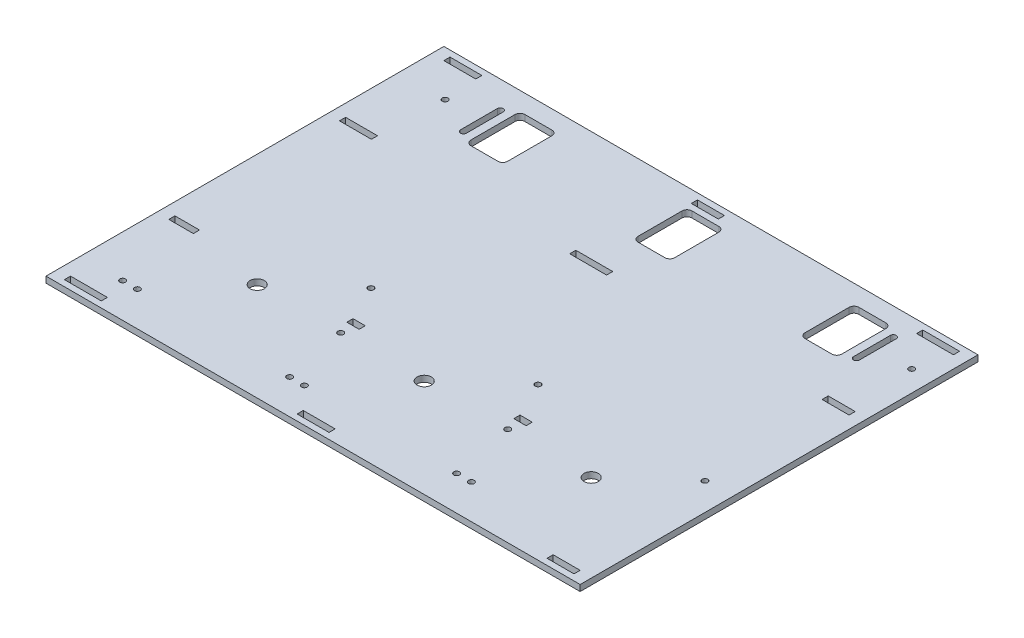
from build123d import *

# Parameters (mm, degrees)
SKETCH1_W             = 276.225
SKETCH1_H             = 205.74
SKETCH1_R             = 3.683
SKETCH1_W_2           = 13.97
SKETCH1_H_2           = 3.175
SKETCH1_W_3           = 19.05
SKETCH1_W_4           = 16.51
SKETCH1_W_5           = 6.35
SKETCH1_W_6           = 12.7
SKETCH1_H_3           = 27.94
BOSS_EXTRUDE1_DEPTH   = 3.175
F_4_CLEARANCE_HOLE1_D = 2.9464
FILLET1_R             = 2.54


with BuildPart() as part:
    # Sketch1 → Boss-Extrude1 (new body)
    with BuildSketch(Plane(origin=(0, 0, 0), x_dir=(1, 0, 0), z_dir=(0, 1, 0))):
        with Locations((138.1125, 102.87)):
            Rectangle(SKETCH1_W, SKETCH1_H)
        with Locations(Location((231.14, 50.8, 0), (0, 0, 270))):
            Circle(SKETCH1_R, mode=Mode.SUBTRACT)
        with Locations(Location((144.78, 50.8, 0), (0, 0, 270))):
            Circle(SKETCH1_R, mode=Mode.SUBTRACT)
        with Locations(Location((58.42, 50.8, 0), (0, 0, 270))):
            Circle(SKETCH1_R, mode=Mode.SUBTRACT)
        with Locations((262.89, 147.0025)):
            Rectangle(SKETCH1_W_2, SKETCH1_H_2, mode=Mode.SUBTRACT)
        with Locations((260.35, 200.9775)):
            Rectangle(SKETCH1_W_3, SKETCH1_H_2, mode=Mode.SUBTRACT)
        with Locations((141.2875, 200.9775)):
            Rectangle(SKETCH1_W_2, SKETCH1_H_2, mode=Mode.SUBTRACT)
        with Locations((14.605, 200.9775)):
            Rectangle(SKETCH1_W_4, SKETCH1_H_2, mode=Mode.SUBTRACT)
        with Locations((134.9375, 147.0025)):
            Rectangle(SKETCH1_W_3, SKETCH1_H_2, mode=Mode.SUBTRACT)
        with Locations((14.605, 147.0025)):
            Rectangle(SKETCH1_W_4, SKETCH1_H_2, mode=Mode.SUBTRACT)
        with Locations((187.96, 58.7375)):
            Rectangle(SKETCH1_W_5, SKETCH1_H_2, mode=Mode.SUBTRACT)
        with Locations((101.6, 58.7375)):
            Rectangle(SKETCH1_W_5, SKETCH1_H_2, mode=Mode.SUBTRACT)
        with Locations((12.7, 58.7375)):
            Rectangle(SKETCH1_W_6, SKETCH1_H_2, mode=Mode.SUBTRACT)
        with Locations((262.89, 4.7625)):
            Rectangle(SKETCH1_W_2, SKETCH1_H_2, mode=Mode.SUBTRACT)
        with Locations((134.9375, 4.7625)):
            Rectangle(SKETCH1_W_4, SKETCH1_H_2, mode=Mode.SUBTRACT)
        with Locations((15.875, 4.7625)):
            Rectangle(SKETCH1_W_3, SKETCH1_H_2, mode=Mode.SUBTRACT)
        with Locations((144.78, 182.245)):
            Rectangle(SKETCH1_W_3, SKETCH1_H_3, mode=Mode.SUBTRACT)
        with Locations((231.14, 182.245)):
            Rectangle(SKETCH1_W_3, SKETCH1_H_3, mode=Mode.SUBTRACT)
        with Locations((58.42, 182.245)):
            Rectangle(SKETCH1_W_3, SKETCH1_H_3, mode=Mode.SUBTRACT)
        with BuildLine():
            Line((44.704, 191.77), (44.704, 172.72))
            ThreePointArc((44.704, 172.72), (43.18, 171.196), (41.656, 172.72))
            Line((41.656, 172.72), (41.656, 191.77))
            ThreePointArc((41.656, 191.77), (43.18, 193.294), (44.704, 191.77))
        make_face(mode=Mode.SUBTRACT)
        with BuildLine():
            Line((247.904, 191.77), (247.904, 172.72))
            ThreePointArc((247.904, 172.72), (246.38, 171.196), (244.856, 172.72))
            Line((244.856, 172.72), (244.856, 191.77))
            ThreePointArc((244.856, 191.77), (246.38, 193.294), (247.904, 191.77))
        make_face(mode=Mode.SUBTRACT)
    extrude(amount=BOSS_EXTRUDE1_DEPTH)

    # 4 Clearance Hole1 (through all)
    with Locations(Plane(origin=(0, 3.175, 0), x_dir=(1, 0, 0), z_dir=(0, 1, 0))):
        with Locations((89.37644085, 78.673304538), (21.80079558, 17.827920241), (29.42079558, 17.827920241), (175.73644085, 78.673304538), (108.16079558, 17.827920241), (262.09644085, 78.673304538), (194.52079558, 17.827920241), (24.13, 182.245), (265.43, 182.245), (115.78079558, 17.827920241), (202.14079558, 17.827920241), (101.6, 50.8), (187.96, 50.8)):
            Hole(F_4_CLEARANCE_HOLE1_D / 2)

    # Fillet1
    fillet1_edges = [part.edges().sort_by_distance(p)[0] for p in [
        (154.305, 1.5875, -168.275),
        (154.305, 1.5875, -196.215),
        (135.255, 1.5875, -196.215),
        (135.255, 1.5875, -168.275),
        (221.615, 1.5875, -196.215),
        (221.615, 1.5875, -168.275),
        (240.665, 1.5875, -168.275),
        (240.665, 1.5875, -196.215),
        (67.945, 1.5875, -168.275),
        (67.945, 1.5875, -196.215),
        (48.895, 1.5875, -196.215),
        (48.895, 1.5875, -168.275),
    ]]
    fillet(fillet1_edges, radius=FILLET1_R)


solid = part.part
